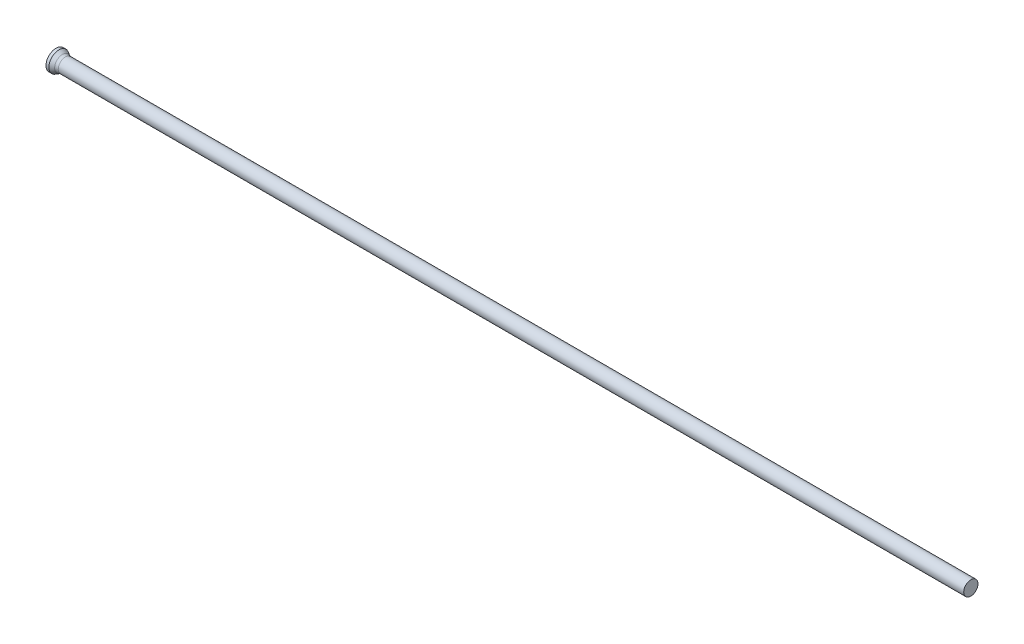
ISO-10303-21;
HEADER;
FILE_DESCRIPTION(('STEP AP214'),'2;1');
FILE_NAME('part.step','',(''),(''),'','','');
FILE_SCHEMA(('AUTOMOTIVE_DESIGN { 1 0 10303 214 1 1 1 1 }'));
ENDSEC;
DATA;
#1=APPLICATION_CONTEXT('core data for automotive mechanical design processes');
#2=APPLICATION_PROTOCOL_DEFINITION('international standard','automotive_design',2000,#1);
#3=PRODUCT_CONTEXT('',#1,'mechanical');
#4=PRODUCT('Part','Part','',(#3));
#5=PRODUCT_RELATED_PRODUCT_CATEGORY('part','',(#4));
#6=PRODUCT_DEFINITION_FORMATION('','',#4);
#7=PRODUCT_DEFINITION_CONTEXT('part definition',#1,'design');
#8=PRODUCT_DEFINITION('design','',#6,#7);
#9=PRODUCT_DEFINITION_SHAPE('','',#8);
#10=(LENGTH_UNIT() NAMED_UNIT(*) SI_UNIT(.MILLI.,.METRE.));
#11=(NAMED_UNIT(*) PLANE_ANGLE_UNIT() SI_UNIT($,.RADIAN.));
#12=(NAMED_UNIT(*) SI_UNIT($,.STERADIAN.) SOLID_ANGLE_UNIT());
#13=UNCERTAINTY_MEASURE_WITH_UNIT(LENGTH_MEASURE(1.E-05),#10,'distance_accuracy_value','');
#14=(GEOMETRIC_REPRESENTATION_CONTEXT(3) GLOBAL_UNCERTAINTY_ASSIGNED_CONTEXT((#13)) GLOBAL_UNIT_ASSIGNED_CONTEXT((#10,
#11,#12)) REPRESENTATION_CONTEXT('',''));
#15=CARTESIAN_POINT('',(0.,0.,0.));
#16=DIRECTION('',(0.,0.,1.));
#17=DIRECTION('',(1.,0.,0.));
#18=AXIS2_PLACEMENT_3D('',#15,#16,#17);
#19=CARTESIAN_POINT('',(0.,0.,0.));
#20=DIRECTION('',(1.,0.,0.));
#21=DIRECTION('',(0.,0.,-1.));
#22=AXIS2_PLACEMENT_3D('',#19,#20,#21);
#23=PLANE('',#22);
#24=CARTESIAN_POINT('',(0.,0.,0.));
#25=DIRECTION('',(-1.,0.,0.));
#26=DIRECTION('',(0.,0.,1.));
#27=AXIS2_PLACEMENT_3D('',#24,#25,#26);
#28=CIRCLE('',#27,1.75);
#29=CARTESIAN_POINT('',(0.,0.,1.75));
#30=VERTEX_POINT('',#29);
#31=EDGE_CURVE('E25',#30,#30,#28,.T.);
#32=ORIENTED_EDGE('',*,*,#31,.T.);
#33=EDGE_LOOP('',(#32));
#34=FACE_BOUND('',#33,.T.);
#35=ADVANCED_FACE('F14',(#34),#23,.F.);
#36=CARTESIAN_POINT('',(0.,0.,0.));
#37=DIRECTION('',(-1.,0.,0.));
#38=DIRECTION('',(0.,0.,1.));
#39=AXIS2_PLACEMENT_3D('',#36,#37,#38);
#40=CYLINDRICAL_SURFACE('',#39,1.75);
#41=ORIENTED_EDGE('',*,*,#31,.F.);
#42=EDGE_LOOP('',(#41));
#43=FACE_BOUND('',#42,.T.);
#44=CARTESIAN_POINT('',(0.503974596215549,0.,0.));
#45=DIRECTION('',(-1.,0.,0.));
#46=DIRECTION('',(0.,0.,1.));
#47=AXIS2_PLACEMENT_3D('',#44,#45,#46);
#48=CIRCLE('',#47,1.75);
#49=CARTESIAN_POINT('',(0.503974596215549,0.,1.75));
#50=VERTEX_POINT('',#49);
#51=EDGE_CURVE('E29',#50,#50,#48,.T.);
#52=ORIENTED_EDGE('',*,*,#51,.T.);
#53=EDGE_LOOP('',(#52));
#54=FACE_BOUND('',#53,.T.);
#55=ADVANCED_FACE('F53',(#43,#54),#40,.T.);
#56=CARTESIAN_POINT('',(1.37,0.,0.));
#57=DIRECTION('',(-1.,0.,0.));
#58=DIRECTION('',(0.,0.,1.));
#59=AXIS2_PLACEMENT_3D('',#56,#57,#58);
#60=CONICAL_SURFACE('',#59,1.25,0.523598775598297);
#61=CARTESIAN_POINT('',(1.13794919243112,0.,0.));
#62=DIRECTION('',(-1.,0.,0.));
#63=DIRECTION('',(0.,0.,1.));
#64=AXIS2_PLACEMENT_3D('',#61,#62,#63);
#65=CIRCLE('',#64,1.38397459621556);
#66=CARTESIAN_POINT('',(1.13794919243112,0.,1.38397459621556));
#67=VERTEX_POINT('',#66);
#68=EDGE_CURVE('E21',#67,#67,#65,.T.);
#69=ORIENTED_EDGE('',*,*,#68,.T.);
#70=EDGE_LOOP('',(#69));
#71=FACE_BOUND('',#70,.T.);
#72=ORIENTED_EDGE('',*,*,#51,.F.);
#73=EDGE_LOOP('',(#72));
#74=FACE_BOUND('',#73,.T.);
#75=ADVANCED_FACE('F50',(#71,#74),#60,.T.);
#76=CARTESIAN_POINT('',(0.,0.,0.));
#77=DIRECTION('',(-1.,0.,0.));
#78=DIRECTION('',(0.,0.,1.));
#79=AXIS2_PLACEMENT_3D('',#76,#77,#78);
#80=CYLINDRICAL_SURFACE('',#79,1.25);
#81=CARTESIAN_POINT('',(1.63794919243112,0.,0.));
#82=DIRECTION('',(-1.,0.,0.));
#83=DIRECTION('',(0.,0.,1.));
#84=AXIS2_PLACEMENT_3D('',#81,#82,#83);
#85=CIRCLE('',#84,1.25);
#86=CARTESIAN_POINT('',(1.63794919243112,0.,1.25));
#87=VERTEX_POINT('',#86);
#88=EDGE_CURVE('E9',#87,#87,#85,.F.);
#89=ORIENTED_EDGE('',*,*,#88,.T.);
#90=EDGE_LOOP('',(#89));
#91=FACE_BOUND('',#90,.T.);
#92=CARTESIAN_POINT('',(160.,0.,0.));
#93=DIRECTION('',(-1.,0.,0.));
#94=DIRECTION('',(0.,0.,1.));
#95=AXIS2_PLACEMENT_3D('',#92,#93,#94);
#96=CIRCLE('',#95,1.25);
#97=CARTESIAN_POINT('',(160.,0.,1.25));
#98=VERTEX_POINT('',#97);
#99=EDGE_CURVE('E34',#98,#98,#96,.T.);
#100=ORIENTED_EDGE('',*,*,#99,.T.);
#101=EDGE_LOOP('',(#100));
#102=FACE_BOUND('',#101,.T.);
#103=ADVANCED_FACE('F38',(#91,#102),#80,.T.);
#104=CARTESIAN_POINT('',(160.,1.25,0.));
#105=DIRECTION('',(-1.,0.,0.));
#106=DIRECTION('',(0.,0.,1.));
#107=AXIS2_PLACEMENT_3D('',#104,#105,#106);
#108=PLANE('',#107);
#109=ORIENTED_EDGE('',*,*,#99,.F.);
#110=EDGE_LOOP('',(#109));
#111=FACE_BOUND('',#110,.T.);
#112=ADVANCED_FACE('F40',(#111),#108,.F.);
#113=CARTESIAN_POINT('',(1.63794919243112,0.,0.));
#114=DIRECTION('',(-1.,0.,0.));
#115=DIRECTION('',(0.,0.,1.));
#116=AXIS2_PLACEMENT_3D('',#113,#114,#115);
#117=TOROIDAL_SURFACE('',#116,2.25,1.);
#118=ORIENTED_EDGE('',*,*,#88,.F.);
#119=EDGE_LOOP('',(#118));
#120=FACE_BOUND('',#119,.T.);
#121=ORIENTED_EDGE('',*,*,#68,.F.);
#122=EDGE_LOOP('',(#121));
#123=FACE_BOUND('',#122,.T.);
#124=ADVANCED_FACE('F16',(#120,#123),#117,.F.);
#125=CLOSED_SHELL('',(#35,#55,#75,#103,#112,#124));
#126=MANIFOLD_SOLID_BREP('B1',#125);
#127=ADVANCED_BREP_SHAPE_REPRESENTATION('',(#18,#126),#14);
#128=SHAPE_DEFINITION_REPRESENTATION(#9,#127);
ENDSEC;
END-ISO-10303-21;
